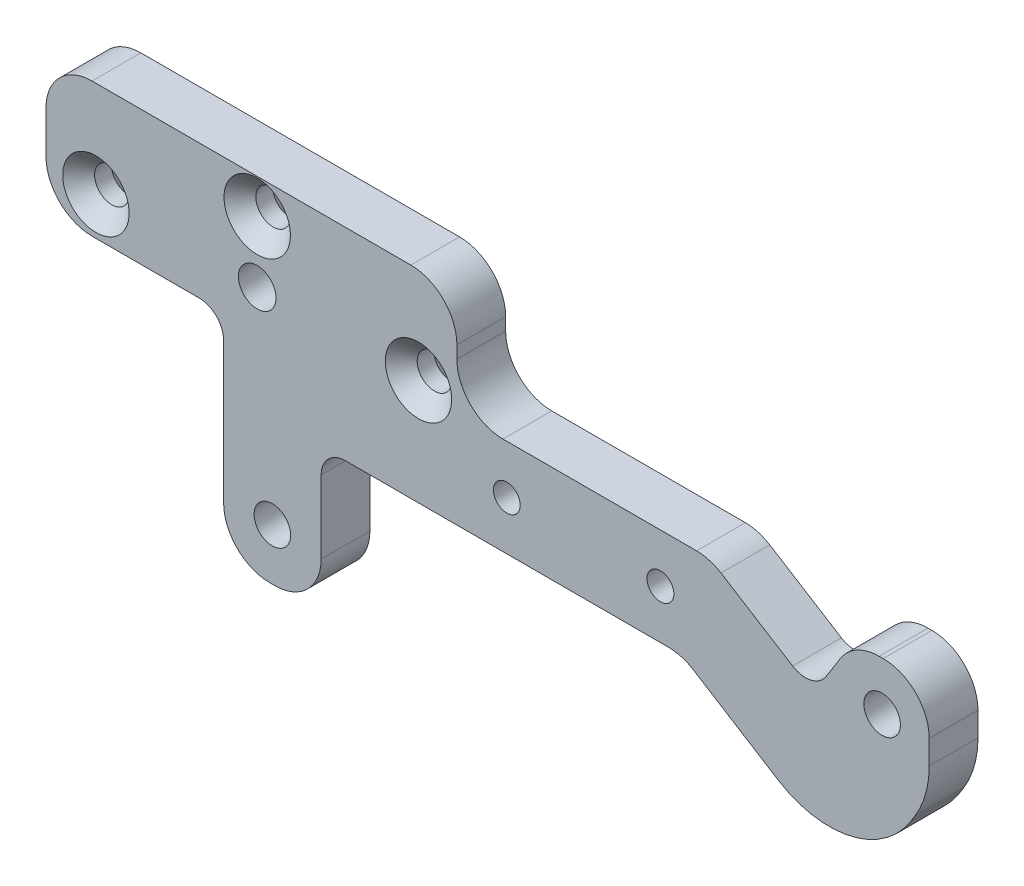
ISO-10303-21;
HEADER;
FILE_DESCRIPTION(('STEP AP214'),'2;1');
FILE_NAME('part.step','',(''),(''),'','','');
FILE_SCHEMA(('AUTOMOTIVE_DESIGN { 1 0 10303 214 1 1 1 1 }'));
ENDSEC;
DATA;
#1=APPLICATION_CONTEXT('core data for automotive mechanical design processes');
#2=APPLICATION_PROTOCOL_DEFINITION('international standard','automotive_design',2000,#1);
#3=PRODUCT_CONTEXT('',#1,'mechanical');
#4=PRODUCT('Part','Part','',(#3));
#5=PRODUCT_RELATED_PRODUCT_CATEGORY('part','',(#4));
#6=PRODUCT_DEFINITION_FORMATION('','',#4);
#7=PRODUCT_DEFINITION_CONTEXT('part definition',#1,'design');
#8=PRODUCT_DEFINITION('design','',#6,#7);
#9=PRODUCT_DEFINITION_SHAPE('','',#8);
#10=(LENGTH_UNIT() NAMED_UNIT(*) SI_UNIT(.MILLI.,.METRE.));
#11=(NAMED_UNIT(*) PLANE_ANGLE_UNIT() SI_UNIT($,.RADIAN.));
#12=(NAMED_UNIT(*) SI_UNIT($,.STERADIAN.) SOLID_ANGLE_UNIT());
#13=UNCERTAINTY_MEASURE_WITH_UNIT(LENGTH_MEASURE(1.E-05),#10,'distance_accuracy_value','');
#14=(GEOMETRIC_REPRESENTATION_CONTEXT(3) GLOBAL_UNCERTAINTY_ASSIGNED_CONTEXT((#13)) GLOBAL_UNIT_ASSIGNED_CONTEXT((#10,
#11,#12)) REPRESENTATION_CONTEXT('',''));
#15=CARTESIAN_POINT('',(0.,0.,0.));
#16=DIRECTION('',(0.,0.,1.));
#17=DIRECTION('',(1.,0.,0.));
#18=AXIS2_PLACEMENT_3D('',#15,#16,#17);
#19=CARTESIAN_POINT('',(175.,-27.64,0.));
#20=DIRECTION('',(0.,1.,0.));
#21=DIRECTION('',(-1.,0.,0.));
#22=AXIS2_PLACEMENT_3D('',#19,#20,#21);
#23=PLANE('',#22);
#24=DIRECTION('',(-1.,0.,0.));
#25=VECTOR('',#24,1.);
#26=CARTESIAN_POINT('',(175.,-27.64,0.));
#27=LINE('',#26,#25);
#28=CARTESIAN_POINT('',(107.139435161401,-27.64,0.));
#29=VERTEX_POINT('',#28);
#30=CARTESIAN_POINT('',(23.,-27.64,0.));
#31=VERTEX_POINT('',#30);
#32=EDGE_CURVE('E727',#29,#31,#27,.T.);
#33=ORIENTED_EDGE('',*,*,#32,.F.);
#34=DIRECTION('',(0.,0.,-1.));
#35=VECTOR('',#34,1.);
#36=CARTESIAN_POINT('',(107.139435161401,-27.64,12.7));
#37=LINE('',#36,#35);
#38=CARTESIAN_POINT('',(107.139435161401,-27.64,12.7));
#39=VERTEX_POINT('',#38);
#40=EDGE_CURVE('E56',#29,#39,#37,.F.);
#41=ORIENTED_EDGE('',*,*,#40,.T.);
#42=DIRECTION('',(-1.,0.,0.));
#43=VECTOR('',#42,1.);
#44=CARTESIAN_POINT('',(175.,-27.64,12.7));
#45=LINE('',#44,#43);
#46=CARTESIAN_POINT('',(23.,-27.64,12.7));
#47=VERTEX_POINT('',#46);
#48=EDGE_CURVE('E723',#39,#47,#45,.T.);
#49=ORIENTED_EDGE('',*,*,#48,.T.);
#50=DIRECTION('',(0.,0.,1.));
#51=VECTOR('',#50,1.);
#52=CARTESIAN_POINT('',(23.,-27.64,0.));
#53=LINE('',#52,#51);
#54=EDGE_CURVE('E364',#47,#31,#53,.F.);
#55=ORIENTED_EDGE('',*,*,#54,.T.);
#56=EDGE_LOOP('',(#33,#41,#49,#55));
#57=FACE_BOUND('',#56,.T.);
#58=ADVANCED_FACE('F34',(#57),#23,.F.);
#59=CARTESIAN_POINT('',(175.,-2.24,0.));
#60=DIRECTION('',(0.,-1.,0.));
#61=DIRECTION('',(1.,0.,0.));
#62=AXIS2_PLACEMENT_3D('',#59,#60,#61);
#63=PLANE('',#62);
#64=DIRECTION('',(1.,0.,0.));
#65=VECTOR('',#64,1.);
#66=CARTESIAN_POINT('',(175.,-2.24,12.7));
#67=LINE('',#66,#65);
#68=CARTESIAN_POINT('',(161.978230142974,-2.24,12.7));
#69=VERTEX_POINT('',#68);
#70=CARTESIAN_POINT('',(163.,-2.24,12.7));
#71=VERTEX_POINT('',#70);
#72=EDGE_CURVE('E502',#69,#71,#67,.T.);
#73=ORIENTED_EDGE('',*,*,#72,.T.);
#74=DIRECTION('',(0.,0.,1.));
#75=VECTOR('',#74,1.);
#76=CARTESIAN_POINT('',(163.,-2.24,0.));
#77=LINE('',#76,#75);
#78=CARTESIAN_POINT('',(163.,-2.24,0.));
#79=VERTEX_POINT('',#78);
#80=EDGE_CURVE('E326',#71,#79,#77,.F.);
#81=ORIENTED_EDGE('',*,*,#80,.T.);
#82=DIRECTION('',(1.,0.,0.));
#83=VECTOR('',#82,1.);
#84=CARTESIAN_POINT('',(175.,-2.24,0.));
#85=LINE('',#84,#83);
#86=CARTESIAN_POINT('',(161.978230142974,-2.24,0.));
#87=VERTEX_POINT('',#86);
#88=EDGE_CURVE('E495',#87,#79,#85,.T.);
#89=ORIENTED_EDGE('',*,*,#88,.F.);
#90=DIRECTION('',(0.,0.,1.));
#91=VECTOR('',#90,1.);
#92=CARTESIAN_POINT('',(161.978230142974,-2.24,0.));
#93=LINE('',#92,#91);
#94=EDGE_CURVE('E323',#87,#69,#93,.T.);
#95=ORIENTED_EDGE('',*,*,#94,.T.);
#96=EDGE_LOOP('',(#73,#81,#89,#95));
#97=FACE_BOUND('',#96,.T.);
#98=ADVANCED_FACE('F559',(#97),#63,.F.);
#99=CARTESIAN_POINT('',(-55.,25.,12.7));
#100=DIRECTION('',(1.,0.,0.));
#101=DIRECTION('',(0.,1.,0.));
#102=AXIS2_PLACEMENT_3D('',#99,#100,#101);
#103=PLANE('',#102);
#104=DIRECTION('',(0.,-1.,0.));
#105=VECTOR('',#104,1.);
#106=CARTESIAN_POINT('',(-55.,25.,0.));
#107=LINE('',#106,#105);
#108=CARTESIAN_POINT('',(-55.,13.,0.));
#109=VERTEX_POINT('',#108);
#110=CARTESIAN_POINT('',(-55.,2.00000000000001,0.));
#111=VERTEX_POINT('',#110);
#112=EDGE_CURVE('E248',#109,#111,#107,.T.);
#113=ORIENTED_EDGE('',*,*,#112,.T.);
#114=DIRECTION('',(0.,0.,1.));
#115=VECTOR('',#114,1.);
#116=CARTESIAN_POINT('',(-55.,2.,12.7));
#117=LINE('',#116,#115);
#118=CARTESIAN_POINT('',(-55.,2.00000000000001,12.7));
#119=VERTEX_POINT('',#118);
#120=EDGE_CURVE('E252',#111,#119,#117,.T.);
#121=ORIENTED_EDGE('',*,*,#120,.T.);
#122=DIRECTION('',(0.,-1.,0.));
#123=VECTOR('',#122,1.);
#124=CARTESIAN_POINT('',(-55.,25.,12.7));
#125=LINE('',#124,#123);
#126=CARTESIAN_POINT('',(-55.,13.,12.7));
#127=VERTEX_POINT('',#126);
#128=EDGE_CURVE('E251',#127,#119,#125,.T.);
#129=ORIENTED_EDGE('',*,*,#128,.F.);
#130=DIRECTION('',(0.,0.,-1.));
#131=VECTOR('',#130,1.);
#132=CARTESIAN_POINT('',(-55.,13.,12.7));
#133=LINE('',#132,#131);
#134=EDGE_CURVE('E235',#127,#109,#133,.T.);
#135=ORIENTED_EDGE('',*,*,#134,.T.);
#136=EDGE_LOOP('',(#113,#121,#129,#135));
#137=FACE_BOUND('',#136,.T.);
#138=ADVANCED_FACE('F246',(#137),#103,.F.);
#139=CARTESIAN_POINT('',(-55.,-65.,12.7));
#140=DIRECTION('',(0.,1.,0.));
#141=DIRECTION('',(0.,0.,1.));
#142=AXIS2_PLACEMENT_3D('',#139,#140,#141);
#143=PLANE('',#142);
#144=DIRECTION('',(1.,0.,0.));
#145=VECTOR('',#144,1.);
#146=CARTESIAN_POINT('',(-55.,-65.,12.7));
#147=LINE('',#146,#145);
#148=CARTESIAN_POINT('',(3.25000000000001,-65.,12.7));
#149=VERTEX_POINT('',#148);
#150=CARTESIAN_POINT('',(4.65000000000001,-65.,12.7));
#151=VERTEX_POINT('',#150);
#152=EDGE_CURVE('E470',#149,#151,#147,.T.);
#153=ORIENTED_EDGE('',*,*,#152,.F.);
#154=DIRECTION('',(0.,0.,1.));
#155=VECTOR('',#154,1.);
#156=CARTESIAN_POINT('',(3.25000000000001,-65.,12.7));
#157=LINE('',#156,#155);
#158=CARTESIAN_POINT('',(3.25000000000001,-65.,0.));
#159=VERTEX_POINT('',#158);
#160=EDGE_CURVE('E315',#149,#159,#157,.F.);
#161=ORIENTED_EDGE('',*,*,#160,.T.);
#162=DIRECTION('',(1.,0.,0.));
#163=VECTOR('',#162,1.);
#164=CARTESIAN_POINT('',(-55.,-65.,0.));
#165=LINE('',#164,#163);
#166=CARTESIAN_POINT('',(4.65000000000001,-65.,0.));
#167=VERTEX_POINT('',#166);
#168=EDGE_CURVE('E259',#159,#167,#165,.T.);
#169=ORIENTED_EDGE('',*,*,#168,.T.);
#170=DIRECTION('',(0.,0.,1.));
#171=VECTOR('',#170,1.);
#172=CARTESIAN_POINT('',(4.65000000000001,-65.,12.7));
#173=LINE('',#172,#171);
#174=EDGE_CURVE('E312',#167,#151,#173,.T.);
#175=ORIENTED_EDGE('',*,*,#174,.T.);
#176=EDGE_LOOP('',(#153,#161,#169,#175));
#177=FACE_BOUND('',#176,.T.);
#178=ADVANCED_FACE('F687',(#177),#143,.F.);
#179=CARTESIAN_POINT('',(175.,25.,12.7));
#180=DIRECTION('',(-1.,0.,0.));
#181=DIRECTION('',(0.,0.,1.));
#182=AXIS2_PLACEMENT_3D('',#179,#180,#181);
#183=PLANE('',#182);
#184=DIRECTION('',(0.,1.,0.));
#185=VECTOR('',#184,1.);
#186=CARTESIAN_POINT('',(175.,25.,12.7));
#187=LINE('',#186,#185);
#188=CARTESIAN_POINT('',(175.,-20.4713653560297,12.7));
#189=VERTEX_POINT('',#188);
#190=CARTESIAN_POINT('',(175.,-14.24,12.7));
#191=VERTEX_POINT('',#190);
#192=EDGE_CURVE('E472',#189,#191,#187,.T.);
#193=ORIENTED_EDGE('',*,*,#192,.F.);
#194=DIRECTION('',(0.,0.,1.));
#195=VECTOR('',#194,1.);
#196=CARTESIAN_POINT('',(175.,-20.4713653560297,12.7));
#197=LINE('',#196,#195);
#198=CARTESIAN_POINT('',(175.,-20.4713653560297,0.));
#199=VERTEX_POINT('',#198);
#200=EDGE_CURVE('E398',#189,#199,#197,.F.);
#201=ORIENTED_EDGE('',*,*,#200,.T.);
#202=DIRECTION('',(0.,1.,0.));
#203=VECTOR('',#202,1.);
#204=CARTESIAN_POINT('',(175.,25.,0.));
#205=LINE('',#204,#203);
#206=CARTESIAN_POINT('',(175.,-14.24,0.));
#207=VERTEX_POINT('',#206);
#208=EDGE_CURVE('E263',#199,#207,#205,.T.);
#209=ORIENTED_EDGE('',*,*,#208,.T.);
#210=DIRECTION('',(0.,0.,1.));
#211=VECTOR('',#210,1.);
#212=CARTESIAN_POINT('',(175.,-14.24,12.7));
#213=LINE('',#212,#211);
#214=EDGE_CURVE('E320',#207,#191,#213,.T.);
#215=ORIENTED_EDGE('',*,*,#214,.T.);
#216=EDGE_LOOP('',(#193,#201,#209,#215));
#217=FACE_BOUND('',#216,.T.);
#218=ADVANCED_FACE('F554',(#217),#183,.F.);
#219=CARTESIAN_POINT('',(-55.,25.,12.7));
#220=DIRECTION('',(0.,-1.,0.));
#221=DIRECTION('',(0.,0.,-1.));
#222=AXIS2_PLACEMENT_3D('',#219,#220,#221);
#223=PLANE('',#222);
#224=DIRECTION('',(-1.,0.,0.));
#225=VECTOR('',#224,1.);
#226=CARTESIAN_POINT('',(-55.,25.,12.7));
#227=LINE('',#226,#225);
#228=CARTESIAN_POINT('',(40.,25.,12.7));
#229=VERTEX_POINT('',#228);
#230=CARTESIAN_POINT('',(-43.,25.,12.7));
#231=VERTEX_POINT('',#230);
#232=EDGE_CURVE('E253',#229,#231,#227,.T.);
#233=ORIENTED_EDGE('',*,*,#232,.F.);
#234=DIRECTION('',(0.,0.,1.));
#235=VECTOR('',#234,1.);
#236=CARTESIAN_POINT('',(40.,25.,12.7));
#237=LINE('',#236,#235);
#238=CARTESIAN_POINT('',(40.,25.,0.));
#239=VERTEX_POINT('',#238);
#240=EDGE_CURVE('E345',#229,#239,#237,.F.);
#241=ORIENTED_EDGE('',*,*,#240,.T.);
#242=DIRECTION('',(-1.,0.,0.));
#243=VECTOR('',#242,1.);
#244=CARTESIAN_POINT('',(-55.,25.,0.));
#245=LINE('',#244,#243);
#246=CARTESIAN_POINT('',(-43.,25.,0.));
#247=VERTEX_POINT('',#246);
#248=EDGE_CURVE('E272',#239,#247,#245,.T.);
#249=ORIENTED_EDGE('',*,*,#248,.T.);
#250=DIRECTION('',(0.,0.,-1.));
#251=VECTOR('',#250,1.);
#252=CARTESIAN_POINT('',(-43.,25.,12.7));
#253=LINE('',#252,#251);
#254=EDGE_CURVE('E236',#247,#231,#253,.F.);
#255=ORIENTED_EDGE('',*,*,#254,.T.);
#256=EDGE_LOOP('',(#233,#241,#249,#255));
#257=FACE_BOUND('',#256,.T.);
#258=ADVANCED_FACE('F482',(#257),#223,.F.);
#259=CARTESIAN_POINT('',(-55.,-65.,12.7));
#260=DIRECTION('',(0.,0.,1.));
#261=DIRECTION('',(1.,0.,0.));
#262=AXIS2_PLACEMENT_3D('',#259,#260,#261);
#263=PLANE('',#262);
#264=CARTESIAN_POINT('',(65.,-14.94,12.7));
#265=DIRECTION('',(0.,0.,1.));
#266=DIRECTION('',(1.,0.,0.));
#267=AXIS2_PLACEMENT_3D('',#264,#265,#266);
#268=CIRCLE('',#267,3.49999999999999);
#269=CARTESIAN_POINT('',(68.5,-14.94,12.7));
#270=VERTEX_POINT('',#269);
#271=EDGE_CURVE('E1058',#270,#270,#268,.T.);
#272=ORIENTED_EDGE('',*,*,#271,.F.);
#273=EDGE_LOOP('',(#272));
#274=FACE_BOUND('',#273,.T.);
#275=CARTESIAN_POINT('',(105.,-14.94,12.7));
#276=DIRECTION('',(0.,0.,1.));
#277=DIRECTION('',(1.,0.,0.));
#278=AXIS2_PLACEMENT_3D('',#275,#276,#277);
#279=CIRCLE('',#278,3.49999999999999);
#280=CARTESIAN_POINT('',(108.5,-14.94,12.7));
#281=VERTEX_POINT('',#280);
#282=EDGE_CURVE('E1057',#281,#281,#279,.T.);
#283=ORIENTED_EDGE('',*,*,#282,.F.);
#284=EDGE_LOOP('',(#283));
#285=FACE_BOUND('',#284,.T.);
#286=ORIENTED_EDGE('',*,*,#48,.F.);
#287=CARTESIAN_POINT('',(107.139435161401,-39.64,12.7));
#288=DIRECTION('',(0.,0.,1.));
#289=DIRECTION('',(1.,0.,0.));
#290=AXIS2_PLACEMENT_3D('',#287,#288,#289);
#291=CIRCLE('',#290,12.);
#292=CARTESIAN_POINT('',(113.4984663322,-29.4634228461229,12.7));
#293=VERTEX_POINT('',#292);
#294=EDGE_CURVE('E405',#39,#293,#291,.F.);
#295=ORIENTED_EDGE('',*,*,#294,.T.);
#296=DIRECTION('',(0.848048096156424,-0.529919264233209,0.));
#297=VECTOR('',#296,1.);
#298=CARTESIAN_POINT('',(110.580379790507,-27.64,12.7));
#299=LINE('',#298,#297);
#300=CARTESIAN_POINT('',(135.708838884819,-43.3420039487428,12.7));
#301=VERTEX_POINT('',#300);
#302=EDGE_CURVE('E709',#293,#301,#299,.T.);
#303=ORIENTED_EDGE('',*,*,#302,.T.);
#304=CARTESIAN_POINT('',(148.956820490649,-22.1408015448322,12.7));
#305=DIRECTION('',(0.,0.,1.));
#306=DIRECTION('',(1.,0.,0.));
#307=AXIS2_PLACEMENT_3D('',#304,#305,#306);
#308=CIRCLE('',#307,25.);
#309=CARTESIAN_POINT('',(170.15802289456,-35.3887831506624,12.7));
#310=VERTEX_POINT('',#309);
#311=EDGE_CURVE('E396',#301,#310,#308,.T.);
#312=ORIENTED_EDGE('',*,*,#311,.T.);
#313=DIRECTION('',(0.529919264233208,0.848048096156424,0.));
#314=VECTOR('',#313,1.);
#315=CARTESIAN_POINT('',(156.910041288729,-56.589985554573,12.7));
#316=LINE('',#315,#314);
#317=CARTESIAN_POINT('',(171.201202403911,-33.7193469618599,12.7));
#318=VERTEX_POINT('',#317);
#319=EDGE_CURVE('E706',#310,#318,#316,.T.);
#320=ORIENTED_EDGE('',*,*,#319,.T.);
#321=CARTESIAN_POINT('',(150.,-20.4713653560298,12.7));
#322=DIRECTION('',(0.,0.,1.));
#323=DIRECTION('',(1.,0.,0.));
#324=AXIS2_PLACEMENT_3D('',#321,#322,#323);
#325=CIRCLE('',#324,25.);
#326=EDGE_CURVE('E394',#318,#189,#325,.T.);
#327=ORIENTED_EDGE('',*,*,#326,.T.);
#328=ORIENTED_EDGE('',*,*,#192,.T.);
#329=CARTESIAN_POINT('',(163.,-14.24,12.7));
#330=DIRECTION('',(0.,0.,1.));
#331=DIRECTION('',(1.,0.,0.));
#332=AXIS2_PLACEMENT_3D('',#329,#330,#331);
#333=CIRCLE('',#332,12.);
#334=EDGE_CURVE('E284',#191,#71,#333,.T.);
#335=ORIENTED_EDGE('',*,*,#334,.T.);
#336=ORIENTED_EDGE('',*,*,#72,.F.);
#337=CARTESIAN_POINT('',(161.978230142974,-14.24,12.7));
#338=DIRECTION('',(0.,0.,1.));
#339=DIRECTION('',(1.,0.,0.));
#340=AXIS2_PLACEMENT_3D('',#337,#338,#339);
#341=CIRCLE('',#340,12.);
#342=CARTESIAN_POINT('',(151.801652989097,-7.8809688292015,12.7));
#343=VERTEX_POINT('',#342);
#344=EDGE_CURVE('E281',#69,#343,#341,.T.);
#345=ORIENTED_EDGE('',*,*,#344,.T.);
#346=DIRECTION('',(0.529919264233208,0.848048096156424,0.));
#347=VECTOR('',#346,1.);
#348=CARTESIAN_POINT('',(155.326521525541,-2.24000000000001,12.7));
#349=LINE('',#348,#347);
#350=CARTESIAN_POINT('',(148.171411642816,-13.6905694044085,12.7));
#351=VERTEX_POINT('',#350);
#352=EDGE_CURVE('E721',#351,#343,#349,.T.);
#353=ORIENTED_EDGE('',*,*,#352,.F.);
#354=CARTESIAN_POINT('',(142.786306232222,-10.3255820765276,12.7));
#355=DIRECTION('',(0.,0.,1.));
#356=DIRECTION('',(1.,0.,0.));
#357=AXIS2_PLACEMENT_3D('',#354,#355,#356);
#358=CIRCLE('',#357,6.35);
#359=CARTESIAN_POINT('',(139.421318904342,-15.7106874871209,12.7));
#360=VERTEX_POINT('',#359);
#361=EDGE_CURVE('E367',#351,#360,#358,.F.);
#362=ORIENTED_EDGE('',*,*,#361,.T.);
#363=DIRECTION('',(0.848048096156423,-0.529919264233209,0.));
#364=VECTOR('',#363,1.);
#365=CARTESIAN_POINT('',(144.806424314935,-19.0756748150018,12.7));
#366=LINE('',#365,#364);
#367=CARTESIAN_POINT('',(120.781799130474,-4.06342284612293,12.7));
#368=VERTEX_POINT('',#367);
#369=EDGE_CURVE('E715',#368,#360,#366,.T.);
#370=ORIENTED_EDGE('',*,*,#369,.F.);
#371=CARTESIAN_POINT('',(114.422767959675,-14.24,12.7));
#372=DIRECTION('',(0.,0.,1.));
#373=DIRECTION('',(1.,0.,0.));
#374=AXIS2_PLACEMENT_3D('',#371,#372,#373);
#375=CIRCLE('',#374,12.);
#376=CARTESIAN_POINT('',(114.422767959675,-2.24000000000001,12.7));
#377=VERTEX_POINT('',#376);
#378=EDGE_CURVE('E279',#368,#377,#375,.T.);
#379=ORIENTED_EDGE('',*,*,#378,.T.);
#380=CARTESIAN_POINT('',(64.,-2.24000000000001,12.7));
#381=VERTEX_POINT('',#380);
#382=EDGE_CURVE('E496',#381,#377,#67,.T.);
#383=ORIENTED_EDGE('',*,*,#382,.F.);
#384=CARTESIAN_POINT('',(64.,9.75999999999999,12.7));
#385=DIRECTION('',(0.,0.,1.));
#386=DIRECTION('',(1.,0.,0.));
#387=AXIS2_PLACEMENT_3D('',#384,#385,#386);
#388=CIRCLE('',#387,12.);
#389=CARTESIAN_POINT('',(52.,9.75999999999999,12.7));
#390=VERTEX_POINT('',#389);
#391=EDGE_CURVE('E347',#381,#390,#388,.F.);
#392=ORIENTED_EDGE('',*,*,#391,.T.);
#393=DIRECTION('',(0.,-1.,0.));
#394=VECTOR('',#393,1.);
#395=CARTESIAN_POINT('',(52.,25.,12.7));
#396=LINE('',#395,#394);
#397=CARTESIAN_POINT('',(52.,13.,12.7));
#398=VERTEX_POINT('',#397);
#399=EDGE_CURVE('E510',#398,#390,#396,.T.);
#400=ORIENTED_EDGE('',*,*,#399,.F.);
#401=CARTESIAN_POINT('',(40.,13.,12.7));
#402=DIRECTION('',(0.,0.,1.));
#403=DIRECTION('',(1.,0.,0.));
#404=AXIS2_PLACEMENT_3D('',#401,#402,#403);
#405=CIRCLE('',#404,12.);
#406=EDGE_CURVE('E277',#398,#229,#405,.T.);
#407=ORIENTED_EDGE('',*,*,#406,.T.);
#408=ORIENTED_EDGE('',*,*,#232,.T.);
#409=CARTESIAN_POINT('',(-43.,13.,12.7));
#410=DIRECTION('',(0.,0.,1.));
#411=DIRECTION('',(1.,0.,0.));
#412=AXIS2_PLACEMENT_3D('',#409,#410,#411);
#413=CIRCLE('',#412,12.);
#414=EDGE_CURVE('E275',#231,#127,#413,.T.);
#415=ORIENTED_EDGE('',*,*,#414,.T.);
#416=ORIENTED_EDGE('',*,*,#128,.T.);
#417=CARTESIAN_POINT('',(-43.,2.,12.7));
#418=DIRECTION('',(0.,0.,1.));
#419=DIRECTION('',(1.,0.,0.));
#420=AXIS2_PLACEMENT_3D('',#417,#418,#419);
#421=CIRCLE('',#420,12.);
#422=CARTESIAN_POINT('',(-43.,-10.,12.7));
#423=VERTEX_POINT('',#422);
#424=EDGE_CURVE('E291',#119,#423,#421,.T.);
#425=ORIENTED_EDGE('',*,*,#424,.T.);
#426=DIRECTION('',(-1.,0.,0.));
#427=VECTOR('',#426,1.);
#428=CARTESIAN_POINT('',(-55.,-10.,12.7));
#429=LINE('',#428,#427);
#430=CARTESIAN_POINT('',(-15.1,-10.,12.7));
#431=VERTEX_POINT('',#430);
#432=EDGE_CURVE('E518',#431,#423,#429,.T.);
#433=ORIENTED_EDGE('',*,*,#432,.F.);
#434=CARTESIAN_POINT('',(-15.1,-16.35,12.7));
#435=DIRECTION('',(0.,0.,1.));
#436=DIRECTION('',(1.,0.,0.));
#437=AXIS2_PLACEMENT_3D('',#434,#435,#436);
#438=CIRCLE('',#437,6.35);
#439=CARTESIAN_POINT('',(-8.74999999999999,-16.35,12.7));
#440=VERTEX_POINT('',#439);
#441=EDGE_CURVE('E371',#431,#440,#438,.F.);
#442=ORIENTED_EDGE('',*,*,#441,.T.);
#443=DIRECTION('',(0.,1.,0.));
#444=VECTOR('',#443,1.);
#445=CARTESIAN_POINT('',(-8.74999999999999,-65.,12.7));
#446=LINE('',#445,#444);
#447=CARTESIAN_POINT('',(-8.74999999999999,-53.,12.7));
#448=VERTEX_POINT('',#447);
#449=EDGE_CURVE('E509',#448,#440,#446,.T.);
#450=ORIENTED_EDGE('',*,*,#449,.F.);
#451=CARTESIAN_POINT('',(3.25000000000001,-53.,12.7));
#452=DIRECTION('',(0.,0.,1.));
#453=DIRECTION('',(1.,0.,0.));
#454=AXIS2_PLACEMENT_3D('',#451,#452,#453);
#455=CIRCLE('',#454,12.);
#456=EDGE_CURVE('E289',#448,#149,#455,.T.);
#457=ORIENTED_EDGE('',*,*,#456,.T.);
#458=ORIENTED_EDGE('',*,*,#152,.T.);
#459=CARTESIAN_POINT('',(4.65000000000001,-53.,12.7));
#460=DIRECTION('',(0.,0.,1.));
#461=DIRECTION('',(1.,0.,0.));
#462=AXIS2_PLACEMENT_3D('',#459,#460,#461);
#463=CIRCLE('',#462,12.);
#464=CARTESIAN_POINT('',(16.65,-53.,12.7));
#465=VERTEX_POINT('',#464);
#466=EDGE_CURVE('E286',#151,#465,#463,.T.);
#467=ORIENTED_EDGE('',*,*,#466,.T.);
#468=DIRECTION('',(0.,-1.,0.));
#469=VECTOR('',#468,1.);
#470=CARTESIAN_POINT('',(16.65,-65.,12.7));
#471=LINE('',#470,#469);
#472=CARTESIAN_POINT('',(16.65,-33.99,12.7));
#473=VERTEX_POINT('',#472);
#474=EDGE_CURVE('E505',#473,#465,#471,.T.);
#475=ORIENTED_EDGE('',*,*,#474,.F.);
#476=CARTESIAN_POINT('',(23.,-33.99,12.7));
#477=DIRECTION('',(0.,0.,1.));
#478=DIRECTION('',(1.,0.,0.));
#479=AXIS2_PLACEMENT_3D('',#476,#477,#478);
#480=CIRCLE('',#479,6.35);
#481=EDGE_CURVE('E375',#473,#47,#480,.F.);
#482=ORIENTED_EDGE('',*,*,#481,.T.);
#483=EDGE_LOOP('',(#286,#295,#303,#312,#320,#327,#328,#335,#336,#345,#353,#362,#370,#379,#383,
#392,#400,#407,#408,#415,#416,#425,#433,#442,#450,#457,#458,#467,#475,#482));
#484=FACE_BOUND('',#483,.T.);
#485=CARTESIAN_POINT('',(3.95000000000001,-51.6,12.7));
#486=DIRECTION('',(0.,0.,1.));
#487=DIRECTION('',(1.,0.,0.));
#488=AXIS2_PLACEMENT_3D('',#485,#486,#487);
#489=CIRCLE('',#488,4.7625);
#490=CARTESIAN_POINT('',(8.71250000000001,-51.6,12.7));
#491=VERTEX_POINT('',#490);
#492=EDGE_CURVE('E520',#491,#491,#489,.T.);
#493=ORIENTED_EDGE('',*,*,#492,.F.);
#494=EDGE_LOOP('',(#493));
#495=FACE_BOUND('',#494,.T.);
#496=CARTESIAN_POINT('',(162.72,-14.94,12.7));
#497=DIRECTION('',(0.,0.,1.));
#498=DIRECTION('',(1.,0.,0.));
#499=AXIS2_PLACEMENT_3D('',#496,#497,#498);
#500=CIRCLE('',#499,4.76250000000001);
#501=CARTESIAN_POINT('',(167.4825,-14.94,12.7));
#502=VERTEX_POINT('',#501);
#503=EDGE_CURVE('E525',#502,#502,#500,.T.);
#504=ORIENTED_EDGE('',*,*,#503,.F.);
#505=EDGE_LOOP('',(#504));
#506=FACE_BOUND('',#505,.T.);
#507=CARTESIAN_POINT('',(-42.,0.,12.7));
#508=DIRECTION('',(0.,0.,1.));
#509=DIRECTION('',(1.,0.,0.));
#510=AXIS2_PLACEMENT_3D('',#507,#508,#509);
#511=CIRCLE('',#510,8.65);
#512=CARTESIAN_POINT('',(-33.35,0.,12.7));
#513=VERTEX_POINT('',#512);
#514=EDGE_CURVE('E529',#513,#513,#511,.T.);
#515=ORIENTED_EDGE('',*,*,#514,.F.);
#516=EDGE_LOOP('',(#515));
#517=FACE_BOUND('',#516,.T.);
#518=CARTESIAN_POINT('',(0.,16.,12.7));
#519=DIRECTION('',(0.,0.,1.));
#520=DIRECTION('',(1.,0.,0.));
#521=AXIS2_PLACEMENT_3D('',#518,#519,#520);
#522=CIRCLE('',#521,8.65);
#523=CARTESIAN_POINT('',(8.65,16.,12.7));
#524=VERTEX_POINT('',#523);
#525=EDGE_CURVE('E537',#524,#524,#522,.T.);
#526=ORIENTED_EDGE('',*,*,#525,.F.);
#527=EDGE_LOOP('',(#526));
#528=FACE_BOUND('',#527,.T.);
#529=CARTESIAN_POINT('',(42.,0.,12.7));
#530=DIRECTION('',(0.,0.,1.));
#531=DIRECTION('',(1.,0.,0.));
#532=AXIS2_PLACEMENT_3D('',#529,#530,#531);
#533=CIRCLE('',#532,8.65);
#534=CARTESIAN_POINT('',(50.65,0.,12.7));
#535=VERTEX_POINT('',#534);
#536=EDGE_CURVE('E466',#535,#535,#533,.T.);
#537=ORIENTED_EDGE('',*,*,#536,.F.);
#538=EDGE_LOOP('',(#537));
#539=FACE_BOUND('',#538,.T.);
#540=CARTESIAN_POINT('',(0.,0.,12.7));
#541=DIRECTION('',(0.,0.,1.));
#542=DIRECTION('',(1.,0.,0.));
#543=AXIS2_PLACEMENT_3D('',#540,#541,#542);
#544=CIRCLE('',#543,4.9);
#545=CARTESIAN_POINT('',(4.9,0.,12.7));
#546=VERTEX_POINT('',#545);
#547=EDGE_CURVE('E266',#546,#546,#544,.T.);
#548=ORIENTED_EDGE('',*,*,#547,.F.);
#549=EDGE_LOOP('',(#548));
#550=FACE_BOUND('',#549,.T.);
#551=ADVANCED_FACE('F433',(#274,#285,#484,#495,#506,#517,#528,#539,#550),#263,.T.);
#552=CARTESIAN_POINT('',(-55.,-65.,0.));
#553=DIRECTION('',(0.,0.,1.));
#554=DIRECTION('',(1.,0.,0.));
#555=AXIS2_PLACEMENT_3D('',#552,#553,#554);
#556=PLANE('',#555);
#557=CARTESIAN_POINT('',(42.,0.,0.));
#558=DIRECTION('',(0.,0.,1.));
#559=DIRECTION('',(1.,0.,0.));
#560=AXIS2_PLACEMENT_3D('',#557,#558,#559);
#561=CIRCLE('',#560,8.64999999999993);
#562=CARTESIAN_POINT('',(50.6499999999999,0.,0.));
#563=VERTEX_POINT('',#562);
#564=EDGE_CURVE('E413',#563,#563,#561,.T.);
#565=ORIENTED_EDGE('',*,*,#564,.T.);
#566=EDGE_LOOP('',(#565));
#567=FACE_BOUND('',#566,.T.);
#568=CARTESIAN_POINT('',(0.,16.,0.));
#569=DIRECTION('',(0.,0.,1.));
#570=DIRECTION('',(1.,0.,0.));
#571=AXIS2_PLACEMENT_3D('',#568,#569,#570);
#572=CIRCLE('',#571,8.64999999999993);
#573=CARTESIAN_POINT('',(8.64999999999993,16.,0.));
#574=VERTEX_POINT('',#573);
#575=EDGE_CURVE('E410',#574,#574,#572,.T.);
#576=ORIENTED_EDGE('',*,*,#575,.T.);
#577=EDGE_LOOP('',(#576));
#578=FACE_BOUND('',#577,.T.);
#579=CARTESIAN_POINT('',(-42.,0.,0.));
#580=DIRECTION('',(0.,0.,1.));
#581=DIRECTION('',(1.,0.,0.));
#582=AXIS2_PLACEMENT_3D('',#579,#580,#581);
#583=CIRCLE('',#582,8.64999999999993);
#584=CARTESIAN_POINT('',(-33.3500000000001,0.,0.));
#585=VERTEX_POINT('',#584);
#586=EDGE_CURVE('E407',#585,#585,#583,.T.);
#587=ORIENTED_EDGE('',*,*,#586,.T.);
#588=EDGE_LOOP('',(#587));
#589=FACE_BOUND('',#588,.T.);
#590=CARTESIAN_POINT('',(65.,-14.94,0.));
#591=DIRECTION('',(0.,0.,1.));
#592=DIRECTION('',(1.,0.,0.));
#593=AXIS2_PLACEMENT_3D('',#590,#591,#592);
#594=CIRCLE('',#593,3.5);
#595=CARTESIAN_POINT('',(68.5,-14.94,0.));
#596=VERTEX_POINT('',#595);
#597=EDGE_CURVE('E441',#596,#596,#594,.T.);
#598=ORIENTED_EDGE('',*,*,#597,.T.);
#599=EDGE_LOOP('',(#598));
#600=FACE_BOUND('',#599,.T.);
#601=CARTESIAN_POINT('',(105.,-14.94,0.));
#602=DIRECTION('',(0.,0.,1.));
#603=DIRECTION('',(1.,0.,0.));
#604=AXIS2_PLACEMENT_3D('',#601,#602,#603);
#605=CIRCLE('',#604,3.5);
#606=CARTESIAN_POINT('',(108.5,-14.94,0.));
#607=VERTEX_POINT('',#606);
#608=EDGE_CURVE('E445',#607,#607,#605,.T.);
#609=ORIENTED_EDGE('',*,*,#608,.T.);
#610=EDGE_LOOP('',(#609));
#611=FACE_BOUND('',#610,.T.);
#612=CARTESIAN_POINT('',(3.95000000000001,-51.6,0.));
#613=DIRECTION('',(0.,0.,1.));
#614=DIRECTION('',(1.,0.,0.));
#615=AXIS2_PLACEMENT_3D('',#612,#613,#614);
#616=CIRCLE('',#615,4.7625);
#617=CARTESIAN_POINT('',(8.71250000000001,-51.6,0.));
#618=VERTEX_POINT('',#617);
#619=EDGE_CURVE('E449',#618,#618,#616,.T.);
#620=ORIENTED_EDGE('',*,*,#619,.T.);
#621=EDGE_LOOP('',(#620));
#622=FACE_BOUND('',#621,.T.);
#623=CARTESIAN_POINT('',(162.72,-14.94,0.));
#624=DIRECTION('',(0.,0.,1.));
#625=DIRECTION('',(1.,0.,0.));
#626=AXIS2_PLACEMENT_3D('',#623,#624,#625);
#627=CIRCLE('',#626,4.76250000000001);
#628=CARTESIAN_POINT('',(167.4825,-14.94,0.));
#629=VERTEX_POINT('',#628);
#630=EDGE_CURVE('E453',#629,#629,#627,.T.);
#631=ORIENTED_EDGE('',*,*,#630,.T.);
#632=EDGE_LOOP('',(#631));
#633=FACE_BOUND('',#632,.T.);
#634=CARTESIAN_POINT('',(0.,0.,0.));
#635=DIRECTION('',(0.,0.,1.));
#636=DIRECTION('',(1.,0.,0.));
#637=AXIS2_PLACEMENT_3D('',#634,#635,#636);
#638=CIRCLE('',#637,4.9);
#639=CARTESIAN_POINT('',(4.9,0.,0.));
#640=VERTEX_POINT('',#639);
#641=EDGE_CURVE('E260',#640,#640,#638,.T.);
#642=ORIENTED_EDGE('',*,*,#641,.T.);
#643=EDGE_LOOP('',(#642));
#644=FACE_BOUND('',#643,.T.);
#645=DIRECTION('',(0.529919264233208,0.848048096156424,0.));
#646=VECTOR('',#645,1.);
#647=CARTESIAN_POINT('',(156.910041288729,-56.589985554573,0.));
#648=LINE('',#647,#646);
#649=CARTESIAN_POINT('',(170.15802289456,-35.3887831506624,0.));
#650=VERTEX_POINT('',#649);
#651=CARTESIAN_POINT('',(171.201202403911,-33.7193469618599,0.));
#652=VERTEX_POINT('',#651);
#653=EDGE_CURVE('E701',#650,#652,#648,.T.);
#654=ORIENTED_EDGE('',*,*,#653,.F.);
#655=CARTESIAN_POINT('',(148.956820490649,-22.1408015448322,0.));
#656=DIRECTION('',(0.,0.,1.));
#657=DIRECTION('',(1.,0.,0.));
#658=AXIS2_PLACEMENT_3D('',#655,#656,#657);
#659=CIRCLE('',#658,25.);
#660=CARTESIAN_POINT('',(135.708838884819,-43.3420039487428,0.));
#661=VERTEX_POINT('',#660);
#662=EDGE_CURVE('E388',#650,#661,#659,.F.);
#663=ORIENTED_EDGE('',*,*,#662,.T.);
#664=DIRECTION('',(0.848048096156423,-0.529919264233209,0.));
#665=VECTOR('',#664,1.);
#666=CARTESIAN_POINT('',(110.580379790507,-27.64,0.));
#667=LINE('',#666,#665);
#668=CARTESIAN_POINT('',(113.4984663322,-29.4634228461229,0.));
#669=VERTEX_POINT('',#668);
#670=EDGE_CURVE('E707',#669,#661,#667,.T.);
#671=ORIENTED_EDGE('',*,*,#670,.F.);
#672=CARTESIAN_POINT('',(107.139435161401,-39.64,0.));
#673=DIRECTION('',(0.,0.,1.));
#674=DIRECTION('',(1.,0.,0.));
#675=AXIS2_PLACEMENT_3D('',#672,#673,#674);
#676=CIRCLE('',#675,12.);
#677=EDGE_CURVE('E49',#669,#29,#676,.T.);
#678=ORIENTED_EDGE('',*,*,#677,.T.);
#679=ORIENTED_EDGE('',*,*,#32,.T.);
#680=CARTESIAN_POINT('',(23.,-33.99,0.));
#681=DIRECTION('',(0.,0.,1.));
#682=DIRECTION('',(1.,0.,0.));
#683=AXIS2_PLACEMENT_3D('',#680,#681,#682);
#684=CIRCLE('',#683,6.35);
#685=CARTESIAN_POINT('',(16.65,-33.99,0.));
#686=VERTEX_POINT('',#685);
#687=EDGE_CURVE('E378',#31,#686,#684,.T.);
#688=ORIENTED_EDGE('',*,*,#687,.T.);
#689=DIRECTION('',(0.,-1.,0.));
#690=VECTOR('',#689,1.);
#691=CARTESIAN_POINT('',(16.65,-65.,0.));
#692=LINE('',#691,#690);
#693=CARTESIAN_POINT('',(16.65,-53.,0.));
#694=VERTEX_POINT('',#693);
#695=EDGE_CURVE('E511',#686,#694,#692,.T.);
#696=ORIENTED_EDGE('',*,*,#695,.T.);
#697=CARTESIAN_POINT('',(4.65000000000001,-53.,0.));
#698=DIRECTION('',(0.,0.,1.));
#699=DIRECTION('',(1.,0.,0.));
#700=AXIS2_PLACEMENT_3D('',#697,#698,#699);
#701=CIRCLE('',#700,12.);
#702=EDGE_CURVE('E304',#694,#167,#701,.F.);
#703=ORIENTED_EDGE('',*,*,#702,.T.);
#704=ORIENTED_EDGE('',*,*,#168,.F.);
#705=CARTESIAN_POINT('',(3.25000000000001,-53.,0.));
#706=DIRECTION('',(0.,0.,1.));
#707=DIRECTION('',(1.,0.,0.));
#708=AXIS2_PLACEMENT_3D('',#705,#706,#707);
#709=CIRCLE('',#708,12.);
#710=CARTESIAN_POINT('',(-8.74999999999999,-53.,0.));
#711=VERTEX_POINT('',#710);
#712=EDGE_CURVE('E306',#159,#711,#709,.F.);
#713=ORIENTED_EDGE('',*,*,#712,.T.);
#714=DIRECTION('',(0.,1.,0.));
#715=VECTOR('',#714,1.);
#716=CARTESIAN_POINT('',(-8.74999999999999,-65.,0.));
#717=LINE('',#716,#715);
#718=CARTESIAN_POINT('',(-8.74999999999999,-16.35,0.));
#719=VERTEX_POINT('',#718);
#720=EDGE_CURVE('E514',#711,#719,#717,.T.);
#721=ORIENTED_EDGE('',*,*,#720,.T.);
#722=CARTESIAN_POINT('',(-15.1,-16.35,0.));
#723=DIRECTION('',(0.,0.,1.));
#724=DIRECTION('',(1.,0.,0.));
#725=AXIS2_PLACEMENT_3D('',#722,#723,#724);
#726=CIRCLE('',#725,6.35);
#727=CARTESIAN_POINT('',(-15.1,-10.,0.));
#728=VERTEX_POINT('',#727);
#729=EDGE_CURVE('E373',#719,#728,#726,.T.);
#730=ORIENTED_EDGE('',*,*,#729,.T.);
#731=DIRECTION('',(-1.,0.,0.));
#732=VECTOR('',#731,1.);
#733=CARTESIAN_POINT('',(-55.,-10.,0.));
#734=LINE('',#733,#732);
#735=CARTESIAN_POINT('',(-43.,-10.,0.));
#736=VERTEX_POINT('',#735);
#737=EDGE_CURVE('E517',#728,#736,#734,.T.);
#738=ORIENTED_EDGE('',*,*,#737,.T.);
#739=CARTESIAN_POINT('',(-43.,2.,0.));
#740=DIRECTION('',(0.,0.,1.));
#741=DIRECTION('',(1.,0.,0.));
#742=AXIS2_PLACEMENT_3D('',#739,#740,#741);
#743=CIRCLE('',#742,12.);
#744=EDGE_CURVE('E258',#736,#111,#743,.F.);
#745=ORIENTED_EDGE('',*,*,#744,.T.);
#746=ORIENTED_EDGE('',*,*,#112,.F.);
#747=CARTESIAN_POINT('',(-43.,13.,0.));
#748=DIRECTION('',(0.,0.,1.));
#749=DIRECTION('',(1.,0.,0.));
#750=AXIS2_PLACEMENT_3D('',#747,#748,#749);
#751=CIRCLE('',#750,12.);
#752=EDGE_CURVE('E231',#109,#247,#751,.F.);
#753=ORIENTED_EDGE('',*,*,#752,.T.);
#754=ORIENTED_EDGE('',*,*,#248,.F.);
#755=CARTESIAN_POINT('',(40.,13.,0.));
#756=DIRECTION('',(0.,0.,1.));
#757=DIRECTION('',(1.,0.,0.));
#758=AXIS2_PLACEMENT_3D('',#755,#756,#757);
#759=CIRCLE('',#758,12.);
#760=CARTESIAN_POINT('',(52.,13.,0.));
#761=VERTEX_POINT('',#760);
#762=EDGE_CURVE('E240',#239,#761,#759,.F.);
#763=ORIENTED_EDGE('',*,*,#762,.T.);
#764=DIRECTION('',(0.,-1.,0.));
#765=VECTOR('',#764,1.);
#766=CARTESIAN_POINT('',(52.,25.,0.));
#767=LINE('',#766,#765);
#768=CARTESIAN_POINT('',(52.,9.75999999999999,0.));
#769=VERTEX_POINT('',#768);
#770=EDGE_CURVE('E489',#761,#769,#767,.T.);
#771=ORIENTED_EDGE('',*,*,#770,.T.);
#772=CARTESIAN_POINT('',(64.,9.75999999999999,0.));
#773=DIRECTION('',(0.,0.,1.));
#774=DIRECTION('',(1.,0.,0.));
#775=AXIS2_PLACEMENT_3D('',#772,#773,#774);
#776=CIRCLE('',#775,12.);
#777=CARTESIAN_POINT('',(64.,-2.24000000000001,0.));
#778=VERTEX_POINT('',#777);
#779=EDGE_CURVE('E349',#769,#778,#776,.T.);
#780=ORIENTED_EDGE('',*,*,#779,.T.);
#781=CARTESIAN_POINT('',(114.422767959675,-2.24000000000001,0.));
#782=VERTEX_POINT('',#781);
#783=EDGE_CURVE('E499',#778,#782,#85,.T.);
#784=ORIENTED_EDGE('',*,*,#783,.T.);
#785=CARTESIAN_POINT('',(114.422767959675,-14.24,0.));
#786=DIRECTION('',(0.,0.,1.));
#787=DIRECTION('',(1.,0.,0.));
#788=AXIS2_PLACEMENT_3D('',#785,#786,#787);
#789=CIRCLE('',#788,12.);
#790=CARTESIAN_POINT('',(120.781799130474,-4.06342284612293,0.));
#791=VERTEX_POINT('',#790);
#792=EDGE_CURVE('E297',#782,#791,#789,.F.);
#793=ORIENTED_EDGE('',*,*,#792,.T.);
#794=DIRECTION('',(0.848048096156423,-0.529919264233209,0.));
#795=VECTOR('',#794,1.);
#796=CARTESIAN_POINT('',(144.806424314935,-19.0756748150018,0.));
#797=LINE('',#796,#795);
#798=CARTESIAN_POINT('',(139.421318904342,-15.7106874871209,0.));
#799=VERTEX_POINT('',#798);
#800=EDGE_CURVE('E717',#791,#799,#797,.T.);
#801=ORIENTED_EDGE('',*,*,#800,.T.);
#802=CARTESIAN_POINT('',(142.786306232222,-10.3255820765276,0.));
#803=DIRECTION('',(0.,0.,1.));
#804=DIRECTION('',(1.,0.,0.));
#805=AXIS2_PLACEMENT_3D('',#802,#803,#804);
#806=CIRCLE('',#805,6.35);
#807=CARTESIAN_POINT('',(148.171411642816,-13.6905694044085,0.));
#808=VERTEX_POINT('',#807);
#809=EDGE_CURVE('E369',#799,#808,#806,.T.);
#810=ORIENTED_EDGE('',*,*,#809,.T.);
#811=DIRECTION('',(0.529919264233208,0.848048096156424,0.));
#812=VECTOR('',#811,1.);
#813=CARTESIAN_POINT('',(155.326521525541,-2.24000000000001,0.));
#814=LINE('',#813,#812);
#815=CARTESIAN_POINT('',(151.801652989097,-7.8809688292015,0.));
#816=VERTEX_POINT('',#815);
#817=EDGE_CURVE('E720',#808,#816,#814,.T.);
#818=ORIENTED_EDGE('',*,*,#817,.T.);
#819=CARTESIAN_POINT('',(161.978230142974,-14.24,0.));
#820=DIRECTION('',(0.,0.,1.));
#821=DIRECTION('',(1.,0.,0.));
#822=AXIS2_PLACEMENT_3D('',#819,#820,#821);
#823=CIRCLE('',#822,12.);
#824=EDGE_CURVE('E299',#816,#87,#823,.F.);
#825=ORIENTED_EDGE('',*,*,#824,.T.);
#826=ORIENTED_EDGE('',*,*,#88,.T.);
#827=CARTESIAN_POINT('',(163.,-14.24,0.));
#828=DIRECTION('',(0.,0.,1.));
#829=DIRECTION('',(1.,0.,0.));
#830=AXIS2_PLACEMENT_3D('',#827,#828,#829);
#831=CIRCLE('',#830,12.);
#832=EDGE_CURVE('E301',#79,#207,#831,.F.);
#833=ORIENTED_EDGE('',*,*,#832,.T.);
#834=ORIENTED_EDGE('',*,*,#208,.F.);
#835=CARTESIAN_POINT('',(150.,-20.4713653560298,0.));
#836=DIRECTION('',(0.,0.,1.));
#837=DIRECTION('',(1.,0.,0.));
#838=AXIS2_PLACEMENT_3D('',#835,#836,#837);
#839=CIRCLE('',#838,25.);
#840=EDGE_CURVE('E386',#199,#652,#839,.F.);
#841=ORIENTED_EDGE('',*,*,#840,.T.);
#842=EDGE_LOOP('',(#654,#663,#671,#678,#679,#688,#696,#703,#704,#713,#721,#730,#738,#745,#746,
#753,#754,#763,#771,#780,#784,#793,#801,#810,#818,#825,#826,#833,#834,#841));
#843=FACE_BOUND('',#842,.T.);
#844=ADVANCED_FACE('F256',(#567,#578,#589,#600,#611,#622,#633,#644,#843),#556,.F.);
#845=CARTESIAN_POINT('',(0.,0.,0.));
#846=DIRECTION('',(0.,0.,1.));
#847=DIRECTION('',(1.,0.,0.));
#848=AXIS2_PLACEMENT_3D('',#845,#846,#847);
#849=CYLINDRICAL_SURFACE('',#848,4.9);
#850=ORIENTED_EDGE('',*,*,#641,.F.);
#851=EDGE_LOOP('',(#850));
#852=FACE_BOUND('',#851,.T.);
#853=ORIENTED_EDGE('',*,*,#547,.T.);
#854=EDGE_LOOP('',(#853));
#855=FACE_BOUND('',#854,.T.);
#856=ADVANCED_FACE('F432',(#852,#855),#849,.F.);
#857=CARTESIAN_POINT('',(42.,0.,12.7));
#858=DIRECTION('',(0.,0.,1.));
#859=DIRECTION('',(1.,0.,0.));
#860=AXIS2_PLACEMENT_3D('',#857,#858,#859);
#861=CYLINDRICAL_SURFACE('',#860,4.5);
#862=CARTESIAN_POINT('',(42.,0.,4.14999999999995));
#863=DIRECTION('',(0.,0.,1.));
#864=DIRECTION('',(1.,0.,0.));
#865=AXIS2_PLACEMENT_3D('',#862,#863,#864);
#866=CIRCLE('',#865,4.5);
#867=CARTESIAN_POINT('',(46.5,0.,4.14999999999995));
#868=VERTEX_POINT('',#867);
#869=EDGE_CURVE('E416',#868,#868,#866,.F.);
#870=ORIENTED_EDGE('',*,*,#869,.T.);
#871=EDGE_LOOP('',(#870));
#872=FACE_BOUND('',#871,.T.);
#873=CARTESIAN_POINT('',(42.,0.,8.55));
#874=DIRECTION('',(0.,0.,1.));
#875=DIRECTION('',(1.,0.,0.));
#876=AXIS2_PLACEMENT_3D('',#873,#874,#875);
#877=CIRCLE('',#876,4.5);
#878=CARTESIAN_POINT('',(46.5,0.,8.55));
#879=VERTEX_POINT('',#878);
#880=EDGE_CURVE('E463',#879,#879,#877,.T.);
#881=ORIENTED_EDGE('',*,*,#880,.T.);
#882=EDGE_LOOP('',(#881));
#883=FACE_BOUND('',#882,.T.);
#884=ADVANCED_FACE('F458',(#872,#883),#861,.F.);
#885=CARTESIAN_POINT('',(42.,0.,12.7));
#886=DIRECTION('',(0.,0.,1.));
#887=DIRECTION('',(1.,0.,0.));
#888=AXIS2_PLACEMENT_3D('',#885,#886,#887);
#889=CONICAL_SURFACE('',#888,8.65,0.785398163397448);
#890=ORIENTED_EDGE('',*,*,#880,.F.);
#891=EDGE_LOOP('',(#890));
#892=FACE_BOUND('',#891,.T.);
#893=ORIENTED_EDGE('',*,*,#536,.T.);
#894=EDGE_LOOP('',(#893));
#895=FACE_BOUND('',#894,.T.);
#896=ADVANCED_FACE('F546',(#892,#895),#889,.F.);
#897=CARTESIAN_POINT('',(0.,16.,12.7));
#898=DIRECTION('',(0.,0.,1.));
#899=DIRECTION('',(1.,0.,0.));
#900=AXIS2_PLACEMENT_3D('',#897,#898,#899);
#901=CYLINDRICAL_SURFACE('',#900,4.5);
#902=CARTESIAN_POINT('',(0.,16.,4.14999999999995));
#903=DIRECTION('',(0.,0.,1.));
#904=DIRECTION('',(1.,0.,0.));
#905=AXIS2_PLACEMENT_3D('',#902,#903,#904);
#906=CIRCLE('',#905,4.5);
#907=CARTESIAN_POINT('',(4.5,16.,4.14999999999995));
#908=VERTEX_POINT('',#907);
#909=EDGE_CURVE('E42',#908,#908,#906,.F.);
#910=ORIENTED_EDGE('',*,*,#909,.T.);
#911=EDGE_LOOP('',(#910));
#912=FACE_BOUND('',#911,.T.);
#913=CARTESIAN_POINT('',(0.,16.,8.55));
#914=DIRECTION('',(0.,0.,1.));
#915=DIRECTION('',(1.,0.,0.));
#916=AXIS2_PLACEMENT_3D('',#913,#914,#915);
#917=CIRCLE('',#916,4.5);
#918=CARTESIAN_POINT('',(4.5,16.,8.55));
#919=VERTEX_POINT('',#918);
#920=EDGE_CURVE('E540',#919,#919,#917,.T.);
#921=ORIENTED_EDGE('',*,*,#920,.T.);
#922=EDGE_LOOP('',(#921));
#923=FACE_BOUND('',#922,.T.);
#924=ADVANCED_FACE('F421',(#912,#923),#901,.F.);
#925=CARTESIAN_POINT('',(0.,16.,12.7));
#926=DIRECTION('',(0.,0.,1.));
#927=DIRECTION('',(1.,0.,0.));
#928=AXIS2_PLACEMENT_3D('',#925,#926,#927);
#929=CONICAL_SURFACE('',#928,8.65,0.785398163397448);
#930=ORIENTED_EDGE('',*,*,#920,.F.);
#931=EDGE_LOOP('',(#930));
#932=FACE_BOUND('',#931,.T.);
#933=ORIENTED_EDGE('',*,*,#525,.T.);
#934=EDGE_LOOP('',(#933));
#935=FACE_BOUND('',#934,.T.);
#936=ADVANCED_FACE('F598',(#932,#935),#929,.F.);
#937=CARTESIAN_POINT('',(-42.,0.,12.7));
#938=DIRECTION('',(0.,0.,1.));
#939=DIRECTION('',(1.,0.,0.));
#940=AXIS2_PLACEMENT_3D('',#937,#938,#939);
#941=CYLINDRICAL_SURFACE('',#940,4.5);
#942=CARTESIAN_POINT('',(-42.,0.,4.14999999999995));
#943=DIRECTION('',(0.,0.,1.));
#944=DIRECTION('',(1.,0.,0.));
#945=AXIS2_PLACEMENT_3D('',#942,#943,#944);
#946=CIRCLE('',#945,4.5);
#947=CARTESIAN_POINT('',(-37.5,0.,4.14999999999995));
#948=VERTEX_POINT('',#947);
#949=EDGE_CURVE('E11',#948,#948,#946,.F.);
#950=ORIENTED_EDGE('',*,*,#949,.T.);
#951=EDGE_LOOP('',(#950));
#952=FACE_BOUND('',#951,.T.);
#953=CARTESIAN_POINT('',(-42.,0.,8.55));
#954=DIRECTION('',(0.,0.,1.));
#955=DIRECTION('',(1.,0.,0.));
#956=AXIS2_PLACEMENT_3D('',#953,#954,#955);
#957=CIRCLE('',#956,4.5);
#958=CARTESIAN_POINT('',(-37.5,0.,8.55));
#959=VERTEX_POINT('',#958);
#960=EDGE_CURVE('E534',#959,#959,#957,.T.);
#961=ORIENTED_EDGE('',*,*,#960,.T.);
#962=EDGE_LOOP('',(#961));
#963=FACE_BOUND('',#962,.T.);
#964=ADVANCED_FACE('F594',(#952,#963),#941,.F.);
#965=CARTESIAN_POINT('',(-42.,0.,12.7));
#966=DIRECTION('',(0.,0.,1.));
#967=DIRECTION('',(1.,0.,0.));
#968=AXIS2_PLACEMENT_3D('',#965,#966,#967);
#969=CONICAL_SURFACE('',#968,8.65,0.785398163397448);
#970=ORIENTED_EDGE('',*,*,#960,.F.);
#971=EDGE_LOOP('',(#970));
#972=FACE_BOUND('',#971,.T.);
#973=ORIENTED_EDGE('',*,*,#514,.T.);
#974=EDGE_LOOP('',(#973));
#975=FACE_BOUND('',#974,.T.);
#976=ADVANCED_FACE('F590',(#972,#975),#969,.F.);
#977=CARTESIAN_POINT('',(162.72,-14.94,0.));
#978=DIRECTION('',(0.,0.,1.));
#979=DIRECTION('',(1.,0.,0.));
#980=AXIS2_PLACEMENT_3D('',#977,#978,#979);
#981=CYLINDRICAL_SURFACE('',#980,4.76250000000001);
#982=ORIENTED_EDGE('',*,*,#630,.F.);
#983=EDGE_LOOP('',(#982));
#984=FACE_BOUND('',#983,.T.);
#985=ORIENTED_EDGE('',*,*,#503,.T.);
#986=EDGE_LOOP('',(#985));
#987=FACE_BOUND('',#986,.T.);
#988=ADVANCED_FACE('F586',(#984,#987),#981,.F.);
#989=CARTESIAN_POINT('',(3.95000000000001,-51.6,0.));
#990=DIRECTION('',(0.,0.,1.));
#991=DIRECTION('',(1.,0.,0.));
#992=AXIS2_PLACEMENT_3D('',#989,#990,#991);
#993=CYLINDRICAL_SURFACE('',#992,4.7625);
#994=ORIENTED_EDGE('',*,*,#619,.F.);
#995=EDGE_LOOP('',(#994));
#996=FACE_BOUND('',#995,.T.);
#997=ORIENTED_EDGE('',*,*,#492,.T.);
#998=EDGE_LOOP('',(#997));
#999=FACE_BOUND('',#998,.T.);
#1000=ADVANCED_FACE('F579',(#996,#999),#993,.F.);
#1001=CARTESIAN_POINT('',(-55.,-10.,0.));
#1002=DIRECTION('',(0.,1.,0.));
#1003=DIRECTION('',(0.,0.,1.));
#1004=AXIS2_PLACEMENT_3D('',#1001,#1002,#1003);
#1005=PLANE('',#1004);
#1006=ORIENTED_EDGE('',*,*,#737,.F.);
#1007=DIRECTION('',(0.,0.,1.));
#1008=VECTOR('',#1007,1.);
#1009=CARTESIAN_POINT('',(-15.1,-10.,12.7));
#1010=LINE('',#1009,#1008);
#1011=EDGE_CURVE('E356',#728,#431,#1010,.T.);
#1012=ORIENTED_EDGE('',*,*,#1011,.T.);
#1013=ORIENTED_EDGE('',*,*,#432,.T.);
#1014=DIRECTION('',(0.,0.,1.));
#1015=VECTOR('',#1014,1.);
#1016=CARTESIAN_POINT('',(-43.,-10.,0.));
#1017=LINE('',#1016,#1015);
#1018=EDGE_CURVE('E241',#423,#736,#1017,.F.);
#1019=ORIENTED_EDGE('',*,*,#1018,.T.);
#1020=EDGE_LOOP('',(#1006,#1012,#1013,#1019));
#1021=FACE_BOUND('',#1020,.T.);
#1022=ADVANCED_FACE('F576',(#1021),#1005,.F.);
#1023=CARTESIAN_POINT('',(-8.74999999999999,-65.,0.));
#1024=DIRECTION('',(1.,0.,0.));
#1025=DIRECTION('',(0.,0.,-1.));
#1026=AXIS2_PLACEMENT_3D('',#1023,#1024,#1025);
#1027=PLANE('',#1026);
#1028=ORIENTED_EDGE('',*,*,#449,.T.);
#1029=DIRECTION('',(0.,0.,1.));
#1030=VECTOR('',#1029,1.);
#1031=CARTESIAN_POINT('',(-8.74999999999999,-16.35,0.));
#1032=LINE('',#1031,#1030);
#1033=EDGE_CURVE('E359',#440,#719,#1032,.F.);
#1034=ORIENTED_EDGE('',*,*,#1033,.T.);
#1035=ORIENTED_EDGE('',*,*,#720,.F.);
#1036=DIRECTION('',(0.,0.,1.));
#1037=VECTOR('',#1036,1.);
#1038=CARTESIAN_POINT('',(-8.74999999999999,-53.,0.));
#1039=LINE('',#1038,#1037);
#1040=EDGE_CURVE('E309',#711,#448,#1039,.T.);
#1041=ORIENTED_EDGE('',*,*,#1040,.T.);
#1042=EDGE_LOOP('',(#1028,#1034,#1035,#1041));
#1043=FACE_BOUND('',#1042,.T.);
#1044=ADVANCED_FACE('F572',(#1043),#1027,.F.);
#1045=ORIENTED_EDGE('',*,*,#382,.T.);
#1046=DIRECTION('',(0.,0.,1.));
#1047=VECTOR('',#1046,1.);
#1048=CARTESIAN_POINT('',(114.422767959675,-2.24000000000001,0.));
#1049=LINE('',#1048,#1047);
#1050=EDGE_CURVE('E337',#377,#782,#1049,.F.);
#1051=ORIENTED_EDGE('',*,*,#1050,.T.);
#1052=ORIENTED_EDGE('',*,*,#783,.F.);
#1053=DIRECTION('',(0.,0.,1.));
#1054=VECTOR('',#1053,1.);
#1055=CARTESIAN_POINT('',(64.,-2.24000000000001,12.7));
#1056=LINE('',#1055,#1054);
#1057=EDGE_CURVE('E334',#778,#381,#1056,.T.);
#1058=ORIENTED_EDGE('',*,*,#1057,.T.);
#1059=EDGE_LOOP('',(#1045,#1051,#1052,#1058));
#1060=FACE_BOUND('',#1059,.T.);
#1061=ADVANCED_FACE('F566',(#1060),#63,.F.);
#1062=CARTESIAN_POINT('',(52.,25.,0.));
#1063=DIRECTION('',(-1.,0.,0.));
#1064=DIRECTION('',(0.,0.,1.));
#1065=AXIS2_PLACEMENT_3D('',#1062,#1063,#1064);
#1066=PLANE('',#1065);
#1067=ORIENTED_EDGE('',*,*,#399,.T.);
#1068=DIRECTION('',(0.,0.,1.));
#1069=VECTOR('',#1068,1.);
#1070=CARTESIAN_POINT('',(52.,9.75999999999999,0.));
#1071=LINE('',#1070,#1069);
#1072=EDGE_CURVE('E342',#390,#769,#1071,.F.);
#1073=ORIENTED_EDGE('',*,*,#1072,.T.);
#1074=ORIENTED_EDGE('',*,*,#770,.F.);
#1075=DIRECTION('',(0.,0.,1.));
#1076=VECTOR('',#1075,1.);
#1077=CARTESIAN_POINT('',(52.,13.,0.));
#1078=LINE('',#1077,#1076);
#1079=EDGE_CURVE('E339',#761,#398,#1078,.T.);
#1080=ORIENTED_EDGE('',*,*,#1079,.T.);
#1081=EDGE_LOOP('',(#1067,#1073,#1074,#1080));
#1082=FACE_BOUND('',#1081,.T.);
#1083=ADVANCED_FACE('F493',(#1082),#1066,.F.);
#1084=CARTESIAN_POINT('',(16.65,-65.,0.));
#1085=DIRECTION('',(-1.,0.,0.));
#1086=DIRECTION('',(0.,0.,1.));
#1087=AXIS2_PLACEMENT_3D('',#1084,#1085,#1086);
#1088=PLANE('',#1087);
#1089=ORIENTED_EDGE('',*,*,#695,.F.);
#1090=DIRECTION('',(0.,0.,1.));
#1091=VECTOR('',#1090,1.);
#1092=CARTESIAN_POINT('',(16.65,-33.99,12.7));
#1093=LINE('',#1092,#1091);
#1094=EDGE_CURVE('E361',#686,#473,#1093,.T.);
#1095=ORIENTED_EDGE('',*,*,#1094,.T.);
#1096=ORIENTED_EDGE('',*,*,#474,.T.);
#1097=DIRECTION('',(0.,0.,1.));
#1098=VECTOR('',#1097,1.);
#1099=CARTESIAN_POINT('',(16.65,-53.,0.));
#1100=LINE('',#1099,#1098);
#1101=EDGE_CURVE('E317',#465,#694,#1100,.F.);
#1102=ORIENTED_EDGE('',*,*,#1101,.T.);
#1103=EDGE_LOOP('',(#1089,#1095,#1096,#1102));
#1104=FACE_BOUND('',#1103,.T.);
#1105=ADVANCED_FACE('F568',(#1104),#1088,.F.);
#1106=CARTESIAN_POINT('',(155.326521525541,-2.24000000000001,0.));
#1107=DIRECTION('',(0.848048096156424,-0.529919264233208,0.));
#1108=DIRECTION('',(0.529919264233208,0.848048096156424,0.));
#1109=AXIS2_PLACEMENT_3D('',#1106,#1107,#1108);
#1110=PLANE('',#1109);
#1111=ORIENTED_EDGE('',*,*,#817,.F.);
#1112=DIRECTION('',(0.,0.,1.));
#1113=VECTOR('',#1112,1.);
#1114=CARTESIAN_POINT('',(148.171411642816,-13.6905694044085,12.7));
#1115=LINE('',#1114,#1113);
#1116=EDGE_CURVE('E351',#808,#351,#1115,.T.);
#1117=ORIENTED_EDGE('',*,*,#1116,.T.);
#1118=ORIENTED_EDGE('',*,*,#352,.T.);
#1119=DIRECTION('',(0.,0.,1.));
#1120=VECTOR('',#1119,1.);
#1121=CARTESIAN_POINT('',(151.801652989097,-7.8809688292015,0.));
#1122=LINE('',#1121,#1120);
#1123=EDGE_CURVE('E328',#343,#816,#1122,.F.);
#1124=ORIENTED_EDGE('',*,*,#1123,.T.);
#1125=EDGE_LOOP('',(#1111,#1117,#1118,#1124));
#1126=FACE_BOUND('',#1125,.T.);
#1127=ADVANCED_FACE('F766',(#1126),#1110,.F.);
#1128=CARTESIAN_POINT('',(144.806424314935,-19.0756748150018,0.));
#1129=DIRECTION('',(-0.529919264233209,-0.848048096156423,0.));
#1130=DIRECTION('',(0.848048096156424,-0.529919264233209,0.));
#1131=AXIS2_PLACEMENT_3D('',#1128,#1129,#1130);
#1132=PLANE('',#1131);
#1133=ORIENTED_EDGE('',*,*,#369,.T.);
#1134=DIRECTION('',(0.,0.,1.));
#1135=VECTOR('',#1134,1.);
#1136=CARTESIAN_POINT('',(139.421318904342,-15.7106874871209,0.));
#1137=LINE('',#1136,#1135);
#1138=EDGE_CURVE('E354',#360,#799,#1137,.F.);
#1139=ORIENTED_EDGE('',*,*,#1138,.T.);
#1140=ORIENTED_EDGE('',*,*,#800,.F.);
#1141=DIRECTION('',(0.,0.,1.));
#1142=VECTOR('',#1141,1.);
#1143=CARTESIAN_POINT('',(120.781799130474,-4.06342284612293,0.));
#1144=LINE('',#1143,#1142);
#1145=EDGE_CURVE('E331',#791,#368,#1144,.T.);
#1146=ORIENTED_EDGE('',*,*,#1145,.T.);
#1147=EDGE_LOOP('',(#1133,#1139,#1140,#1146));
#1148=FACE_BOUND('',#1147,.T.);
#1149=ADVANCED_FACE('F759',(#1148),#1132,.F.);
#1150=CARTESIAN_POINT('',(110.580379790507,-27.64,83.3256973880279));
#1151=DIRECTION('',(0.529919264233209,0.848048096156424,0.));
#1152=DIRECTION('',(-0.848048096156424,0.529919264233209,0.));
#1153=AXIS2_PLACEMENT_3D('',#1150,#1151,#1152);
#1154=PLANE('',#1153);
#1155=ORIENTED_EDGE('',*,*,#302,.F.);
#1156=DIRECTION('',(0.,0.,-1.));
#1157=VECTOR('',#1156,1.);
#1158=CARTESIAN_POINT('',(113.4984663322,-29.4634228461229,0.));
#1159=LINE('',#1158,#1157);
#1160=EDGE_CURVE('E400',#293,#669,#1159,.T.);
#1161=ORIENTED_EDGE('',*,*,#1160,.T.);
#1162=ORIENTED_EDGE('',*,*,#670,.T.);
#1163=DIRECTION('',(0.,0.,-1.));
#1164=VECTOR('',#1163,1.);
#1165=CARTESIAN_POINT('',(135.708838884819,-43.3420039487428,83.3256973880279));
#1166=LINE('',#1165,#1164);
#1167=EDGE_CURVE('E391',#661,#301,#1166,.F.);
#1168=ORIENTED_EDGE('',*,*,#1167,.T.);
#1169=EDGE_LOOP('',(#1155,#1161,#1162,#1168));
#1170=FACE_BOUND('',#1169,.T.);
#1171=ADVANCED_FACE('F755',(#1170),#1154,.F.);
#1172=CARTESIAN_POINT('',(156.910041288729,-56.589985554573,83.3256973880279));
#1173=DIRECTION('',(-0.848048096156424,0.529919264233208,0.));
#1174=DIRECTION('',(-0.529919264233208,-0.848048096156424,0.));
#1175=AXIS2_PLACEMENT_3D('',#1172,#1173,#1174);
#1176=PLANE('',#1175);
#1177=ORIENTED_EDGE('',*,*,#319,.F.);
#1178=DIRECTION('',(0.,0.,-1.));
#1179=VECTOR('',#1178,1.);
#1180=CARTESIAN_POINT('',(170.15802289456,-35.3887831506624,83.3256973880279));
#1181=LINE('',#1180,#1179);
#1182=EDGE_CURVE('E383',#310,#650,#1181,.T.);
#1183=ORIENTED_EDGE('',*,*,#1182,.T.);
#1184=ORIENTED_EDGE('',*,*,#653,.T.);
#1185=DIRECTION('',(0.,0.,1.));
#1186=VECTOR('',#1185,1.);
#1187=CARTESIAN_POINT('',(171.201202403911,-33.7193469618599,83.3256973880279));
#1188=LINE('',#1187,#1186);
#1189=EDGE_CURVE('E380',#652,#318,#1188,.T.);
#1190=ORIENTED_EDGE('',*,*,#1189,.T.);
#1191=EDGE_LOOP('',(#1177,#1183,#1184,#1190));
#1192=FACE_BOUND('',#1191,.T.);
#1193=ADVANCED_FACE('F683',(#1192),#1176,.F.);
#1194=CARTESIAN_POINT('',(-43.,2.,12.7));
#1195=DIRECTION('',(0.,0.,1.));
#1196=DIRECTION('',(1.,0.,0.));
#1197=AXIS2_PLACEMENT_3D('',#1194,#1195,#1196);
#1198=CYLINDRICAL_SURFACE('',#1197,12.);
#1199=ORIENTED_EDGE('',*,*,#744,.F.);
#1200=ORIENTED_EDGE('',*,*,#1018,.F.);
#1201=ORIENTED_EDGE('',*,*,#424,.F.);
#1202=ORIENTED_EDGE('',*,*,#120,.F.);
#1203=EDGE_LOOP('',(#1199,#1200,#1201,#1202));
#1204=FACE_BOUND('',#1203,.T.);
#1205=ADVANCED_FACE('F679',(#1204),#1198,.T.);
#1206=CARTESIAN_POINT('',(3.25000000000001,-53.,0.));
#1207=DIRECTION('',(0.,0.,1.));
#1208=DIRECTION('',(1.,0.,0.));
#1209=AXIS2_PLACEMENT_3D('',#1206,#1207,#1208);
#1210=CYLINDRICAL_SURFACE('',#1209,12.);
#1211=ORIENTED_EDGE('',*,*,#712,.F.);
#1212=ORIENTED_EDGE('',*,*,#160,.F.);
#1213=ORIENTED_EDGE('',*,*,#456,.F.);
#1214=ORIENTED_EDGE('',*,*,#1040,.F.);
#1215=EDGE_LOOP('',(#1211,#1212,#1213,#1214));
#1216=FACE_BOUND('',#1215,.T.);
#1217=ADVANCED_FACE('F675',(#1216),#1210,.T.);
#1218=CARTESIAN_POINT('',(4.65000000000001,-53.,12.7));
#1219=DIRECTION('',(0.,0.,1.));
#1220=DIRECTION('',(1.,0.,0.));
#1221=AXIS2_PLACEMENT_3D('',#1218,#1219,#1220);
#1222=CYLINDRICAL_SURFACE('',#1221,12.);
#1223=ORIENTED_EDGE('',*,*,#702,.F.);
#1224=ORIENTED_EDGE('',*,*,#1101,.F.);
#1225=ORIENTED_EDGE('',*,*,#466,.F.);
#1226=ORIENTED_EDGE('',*,*,#174,.F.);
#1227=EDGE_LOOP('',(#1223,#1224,#1225,#1226));
#1228=FACE_BOUND('',#1227,.T.);
#1229=ADVANCED_FACE('F671',(#1228),#1222,.T.);
#1230=CARTESIAN_POINT('',(163.,-14.24,12.7));
#1231=DIRECTION('',(0.,0.,1.));
#1232=DIRECTION('',(1.,0.,0.));
#1233=AXIS2_PLACEMENT_3D('',#1230,#1231,#1232);
#1234=CYLINDRICAL_SURFACE('',#1233,12.);
#1235=ORIENTED_EDGE('',*,*,#832,.F.);
#1236=ORIENTED_EDGE('',*,*,#80,.F.);
#1237=ORIENTED_EDGE('',*,*,#334,.F.);
#1238=ORIENTED_EDGE('',*,*,#214,.F.);
#1239=EDGE_LOOP('',(#1235,#1236,#1237,#1238));
#1240=FACE_BOUND('',#1239,.T.);
#1241=ADVANCED_FACE('F667',(#1240),#1234,.T.);
#1242=CARTESIAN_POINT('',(161.978230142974,-14.24,0.));
#1243=DIRECTION('',(0.,0.,1.));
#1244=DIRECTION('',(1.,0.,0.));
#1245=AXIS2_PLACEMENT_3D('',#1242,#1243,#1244);
#1246=CYLINDRICAL_SURFACE('',#1245,12.);
#1247=ORIENTED_EDGE('',*,*,#824,.F.);
#1248=ORIENTED_EDGE('',*,*,#1123,.F.);
#1249=ORIENTED_EDGE('',*,*,#344,.F.);
#1250=ORIENTED_EDGE('',*,*,#94,.F.);
#1251=EDGE_LOOP('',(#1247,#1248,#1249,#1250));
#1252=FACE_BOUND('',#1251,.T.);
#1253=ADVANCED_FACE('F663',(#1252),#1246,.T.);
#1254=CARTESIAN_POINT('',(114.422767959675,-14.24,0.));
#1255=DIRECTION('',(0.,0.,1.));
#1256=DIRECTION('',(1.,0.,0.));
#1257=AXIS2_PLACEMENT_3D('',#1254,#1255,#1256);
#1258=CYLINDRICAL_SURFACE('',#1257,12.);
#1259=ORIENTED_EDGE('',*,*,#792,.F.);
#1260=ORIENTED_EDGE('',*,*,#1050,.F.);
#1261=ORIENTED_EDGE('',*,*,#378,.F.);
#1262=ORIENTED_EDGE('',*,*,#1145,.F.);
#1263=EDGE_LOOP('',(#1259,#1260,#1261,#1262));
#1264=FACE_BOUND('',#1263,.T.);
#1265=ADVANCED_FACE('F659',(#1264),#1258,.T.);
#1266=CARTESIAN_POINT('',(64.,9.75999999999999,0.));
#1267=DIRECTION('',(0.,0.,-1.));
#1268=DIRECTION('',(-1.,0.,0.));
#1269=AXIS2_PLACEMENT_3D('',#1266,#1267,#1268);
#1270=CYLINDRICAL_SURFACE('',#1269,12.);
#1271=ORIENTED_EDGE('',*,*,#779,.F.);
#1272=ORIENTED_EDGE('',*,*,#1072,.F.);
#1273=ORIENTED_EDGE('',*,*,#391,.F.);
#1274=ORIENTED_EDGE('',*,*,#1057,.F.);
#1275=EDGE_LOOP('',(#1271,#1272,#1273,#1274));
#1276=FACE_BOUND('',#1275,.T.);
#1277=ADVANCED_FACE('F656',(#1276),#1270,.F.);
#1278=CARTESIAN_POINT('',(40.,13.,0.));
#1279=DIRECTION('',(0.,0.,1.));
#1280=DIRECTION('',(1.,0.,0.));
#1281=AXIS2_PLACEMENT_3D('',#1278,#1279,#1280);
#1282=CYLINDRICAL_SURFACE('',#1281,12.);
#1283=ORIENTED_EDGE('',*,*,#762,.F.);
#1284=ORIENTED_EDGE('',*,*,#240,.F.);
#1285=ORIENTED_EDGE('',*,*,#406,.F.);
#1286=ORIENTED_EDGE('',*,*,#1079,.F.);
#1287=EDGE_LOOP('',(#1283,#1284,#1285,#1286));
#1288=FACE_BOUND('',#1287,.T.);
#1289=ADVANCED_FACE('F485',(#1288),#1282,.T.);
#1290=CARTESIAN_POINT('',(-43.,13.,12.7));
#1291=DIRECTION('',(0.,0.,-1.));
#1292=DIRECTION('',(-1.,0.,0.));
#1293=AXIS2_PLACEMENT_3D('',#1290,#1291,#1292);
#1294=CYLINDRICAL_SURFACE('',#1293,12.);
#1295=ORIENTED_EDGE('',*,*,#414,.F.);
#1296=ORIENTED_EDGE('',*,*,#254,.F.);
#1297=ORIENTED_EDGE('',*,*,#752,.F.);
#1298=ORIENTED_EDGE('',*,*,#134,.F.);
#1299=EDGE_LOOP('',(#1295,#1296,#1297,#1298));
#1300=FACE_BOUND('',#1299,.T.);
#1301=ADVANCED_FACE('F234',(#1300),#1294,.T.);
#1302=CARTESIAN_POINT('',(142.786306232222,-10.3255820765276,0.));
#1303=DIRECTION('',(0.,0.,-1.));
#1304=DIRECTION('',(-1.,0.,0.));
#1305=AXIS2_PLACEMENT_3D('',#1302,#1303,#1304);
#1306=CYLINDRICAL_SURFACE('',#1305,6.35);
#1307=ORIENTED_EDGE('',*,*,#809,.F.);
#1308=ORIENTED_EDGE('',*,*,#1138,.F.);
#1309=ORIENTED_EDGE('',*,*,#361,.F.);
#1310=ORIENTED_EDGE('',*,*,#1116,.F.);
#1311=EDGE_LOOP('',(#1307,#1308,#1309,#1310));
#1312=FACE_BOUND('',#1311,.T.);
#1313=ADVANCED_FACE('F647',(#1312),#1306,.F.);
#1314=CARTESIAN_POINT('',(-15.1,-16.35,0.));
#1315=DIRECTION('',(0.,0.,-1.));
#1316=DIRECTION('',(-1.,0.,0.));
#1317=AXIS2_PLACEMENT_3D('',#1314,#1315,#1316);
#1318=CYLINDRICAL_SURFACE('',#1317,6.35);
#1319=ORIENTED_EDGE('',*,*,#729,.F.);
#1320=ORIENTED_EDGE('',*,*,#1033,.F.);
#1321=ORIENTED_EDGE('',*,*,#441,.F.);
#1322=ORIENTED_EDGE('',*,*,#1011,.F.);
#1323=EDGE_LOOP('',(#1319,#1320,#1321,#1322));
#1324=FACE_BOUND('',#1323,.T.);
#1325=ADVANCED_FACE('F643',(#1324),#1318,.F.);
#1326=CARTESIAN_POINT('',(23.,-33.99,0.));
#1327=DIRECTION('',(0.,0.,-1.));
#1328=DIRECTION('',(-1.,0.,0.));
#1329=AXIS2_PLACEMENT_3D('',#1326,#1327,#1328);
#1330=CYLINDRICAL_SURFACE('',#1329,6.35);
#1331=ORIENTED_EDGE('',*,*,#687,.F.);
#1332=ORIENTED_EDGE('',*,*,#54,.F.);
#1333=ORIENTED_EDGE('',*,*,#481,.F.);
#1334=ORIENTED_EDGE('',*,*,#1094,.F.);
#1335=EDGE_LOOP('',(#1331,#1332,#1333,#1334));
#1336=FACE_BOUND('',#1335,.T.);
#1337=ADVANCED_FACE('F639',(#1336),#1330,.F.);
#1338=CARTESIAN_POINT('',(148.956820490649,-22.1408015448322,83.3256973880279));
#1339=DIRECTION('',(0.,0.,-1.));
#1340=DIRECTION('',(-1.,0.,0.));
#1341=AXIS2_PLACEMENT_3D('',#1338,#1339,#1340);
#1342=CYLINDRICAL_SURFACE('',#1341,25.);
#1343=ORIENTED_EDGE('',*,*,#311,.F.);
#1344=ORIENTED_EDGE('',*,*,#1167,.F.);
#1345=ORIENTED_EDGE('',*,*,#662,.F.);
#1346=ORIENTED_EDGE('',*,*,#1182,.F.);
#1347=EDGE_LOOP('',(#1343,#1344,#1345,#1346));
#1348=FACE_BOUND('',#1347,.T.);
#1349=ADVANCED_FACE('F635',(#1348),#1342,.T.);
#1350=CARTESIAN_POINT('',(150.,-20.4713653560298,83.3256973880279));
#1351=DIRECTION('',(0.,0.,1.));
#1352=DIRECTION('',(1.,0.,0.));
#1353=AXIS2_PLACEMENT_3D('',#1350,#1351,#1352);
#1354=CYLINDRICAL_SURFACE('',#1353,25.);
#1355=ORIENTED_EDGE('',*,*,#840,.F.);
#1356=ORIENTED_EDGE('',*,*,#200,.F.);
#1357=ORIENTED_EDGE('',*,*,#326,.F.);
#1358=ORIENTED_EDGE('',*,*,#1189,.F.);
#1359=EDGE_LOOP('',(#1355,#1356,#1357,#1358));
#1360=FACE_BOUND('',#1359,.T.);
#1361=ADVANCED_FACE('F631',(#1360),#1354,.T.);
#1362=CARTESIAN_POINT('',(107.139435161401,-39.64,83.3256973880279));
#1363=DIRECTION('',(0.,0.,1.));
#1364=DIRECTION('',(1.,0.,0.));
#1365=AXIS2_PLACEMENT_3D('',#1362,#1363,#1364);
#1366=CYLINDRICAL_SURFACE('',#1365,12.);
#1367=ORIENTED_EDGE('',*,*,#294,.F.);
#1368=ORIENTED_EDGE('',*,*,#40,.F.);
#1369=ORIENTED_EDGE('',*,*,#677,.F.);
#1370=ORIENTED_EDGE('',*,*,#1160,.F.);
#1371=EDGE_LOOP('',(#1367,#1368,#1369,#1370));
#1372=FACE_BOUND('',#1371,.T.);
#1373=ADVANCED_FACE('F628',(#1372),#1366,.F.);
#1374=CARTESIAN_POINT('',(105.,-14.94,12.7));
#1375=DIRECTION('',(0.,0.,1.));
#1376=DIRECTION('',(1.,0.,0.));
#1377=AXIS2_PLACEMENT_3D('',#1374,#1375,#1376);
#1378=CYLINDRICAL_SURFACE('',#1377,3.5);
#1379=ORIENTED_EDGE('',*,*,#608,.F.);
#1380=EDGE_LOOP('',(#1379));
#1381=FACE_BOUND('',#1380,.T.);
#1382=ORIENTED_EDGE('',*,*,#282,.T.);
#1383=EDGE_LOOP('',(#1382));
#1384=FACE_BOUND('',#1383,.T.);
#1385=ADVANCED_FACE('F624',(#1381,#1384),#1378,.F.);
#1386=CARTESIAN_POINT('',(65.,-14.94,12.7));
#1387=DIRECTION('',(0.,0.,1.));
#1388=DIRECTION('',(1.,0.,0.));
#1389=AXIS2_PLACEMENT_3D('',#1386,#1387,#1388);
#1390=CYLINDRICAL_SURFACE('',#1389,3.5);
#1391=ORIENTED_EDGE('',*,*,#597,.F.);
#1392=EDGE_LOOP('',(#1391));
#1393=FACE_BOUND('',#1392,.T.);
#1394=ORIENTED_EDGE('',*,*,#271,.T.);
#1395=EDGE_LOOP('',(#1394));
#1396=FACE_BOUND('',#1395,.T.);
#1397=ADVANCED_FACE('F618',(#1393,#1396),#1390,.F.);
#1398=CARTESIAN_POINT('',(42.,0.,0.));
#1399=DIRECTION('',(0.,0.,-1.));
#1400=DIRECTION('',(-1.,0.,0.));
#1401=AXIS2_PLACEMENT_3D('',#1398,#1399,#1400);
#1402=CONICAL_SURFACE('',#1401,8.64999999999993,0.785398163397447);
#1403=ORIENTED_EDGE('',*,*,#869,.F.);
#1404=EDGE_LOOP('',(#1403));
#1405=FACE_BOUND('',#1404,.T.);
#1406=ORIENTED_EDGE('',*,*,#564,.F.);
#1407=EDGE_LOOP('',(#1406));
#1408=FACE_BOUND('',#1407,.T.);
#1409=ADVANCED_FACE('F427',(#1405,#1408),#1402,.F.);
#1410=CARTESIAN_POINT('',(0.,16.,0.));
#1411=DIRECTION('',(0.,0.,-1.));
#1412=DIRECTION('',(-1.,0.,0.));
#1413=AXIS2_PLACEMENT_3D('',#1410,#1411,#1412);
#1414=CONICAL_SURFACE('',#1413,8.64999999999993,0.785398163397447);
#1415=ORIENTED_EDGE('',*,*,#909,.F.);
#1416=EDGE_LOOP('',(#1415));
#1417=FACE_BOUND('',#1416,.T.);
#1418=ORIENTED_EDGE('',*,*,#575,.F.);
#1419=EDGE_LOOP('',(#1418));
#1420=FACE_BOUND('',#1419,.T.);
#1421=ADVANCED_FACE('F424',(#1417,#1420),#1414,.F.);
#1422=CARTESIAN_POINT('',(-42.,0.,0.));
#1423=DIRECTION('',(0.,0.,-1.));
#1424=DIRECTION('',(-1.,0.,0.));
#1425=AXIS2_PLACEMENT_3D('',#1422,#1423,#1424);
#1426=CONICAL_SURFACE('',#1425,8.64999999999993,0.785398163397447);
#1427=ORIENTED_EDGE('',*,*,#949,.F.);
#1428=EDGE_LOOP('',(#1427));
#1429=FACE_BOUND('',#1428,.T.);
#1430=ORIENTED_EDGE('',*,*,#586,.F.);
#1431=EDGE_LOOP('',(#1430));
#1432=FACE_BOUND('',#1431,.T.);
#1433=ADVANCED_FACE('F36',(#1429,#1432),#1426,.F.);
#1434=CLOSED_SHELL('',(#58,#98,#138,#178,#218,#258,#551,#844,#856,#884,#896,#924,#936,#964,#976,
#988,#1000,#1022,#1044,#1061,#1083,#1105,#1127,#1149,#1171,#1193,#1205,#1217,#1229,#1241,#1253,
#1265,#1277,#1289,#1301,#1313,#1325,#1337,#1349,#1361,#1373,#1385,#1397,#1409,#1421,#1433));
#1435=MANIFOLD_SOLID_BREP('B2',#1434);
#1436=ADVANCED_BREP_SHAPE_REPRESENTATION('',(#18,#1435),#14);
#1437=SHAPE_DEFINITION_REPRESENTATION(#9,#1436);
ENDSEC;
END-ISO-10303-21;
